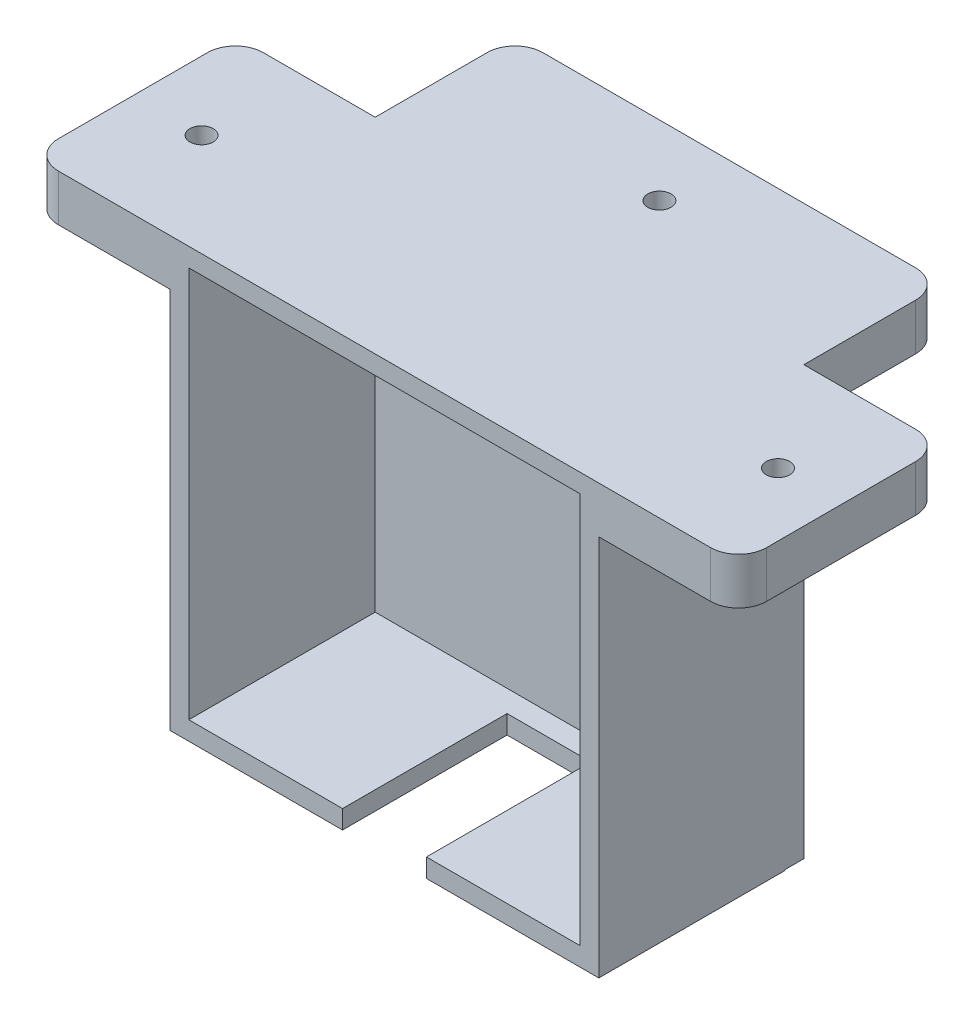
ISO-10303-21;
HEADER;
FILE_DESCRIPTION(('STEP AP214'),'2;1');
FILE_NAME('part.step','',(''),(''),'','','');
FILE_SCHEMA(('AUTOMOTIVE_DESIGN { 1 0 10303 214 1 1 1 1 }'));
ENDSEC;
DATA;
#1=APPLICATION_CONTEXT('core data for automotive mechanical design processes');
#2=APPLICATION_PROTOCOL_DEFINITION('international standard','automotive_design',2000,#1);
#3=PRODUCT_CONTEXT('',#1,'mechanical');
#4=PRODUCT('Part','Part','',(#3));
#5=PRODUCT_RELATED_PRODUCT_CATEGORY('part','',(#4));
#6=PRODUCT_DEFINITION_FORMATION('','',#4);
#7=PRODUCT_DEFINITION_CONTEXT('part definition',#1,'design');
#8=PRODUCT_DEFINITION('design','',#6,#7);
#9=PRODUCT_DEFINITION_SHAPE('','',#8);
#10=(LENGTH_UNIT() NAMED_UNIT(*) SI_UNIT(.MILLI.,.METRE.));
#11=(NAMED_UNIT(*) PLANE_ANGLE_UNIT() SI_UNIT($,.RADIAN.));
#12=(NAMED_UNIT(*) SI_UNIT($,.STERADIAN.) SOLID_ANGLE_UNIT());
#13=UNCERTAINTY_MEASURE_WITH_UNIT(LENGTH_MEASURE(1.E-05),#10,'distance_accuracy_value','');
#14=(GEOMETRIC_REPRESENTATION_CONTEXT(3) GLOBAL_UNCERTAINTY_ASSIGNED_CONTEXT((#13)) GLOBAL_UNIT_ASSIGNED_CONTEXT((#10,
#11,#12)) REPRESENTATION_CONTEXT('',''));
#15=CARTESIAN_POINT('',(0.,0.,0.));
#16=DIRECTION('',(0.,0.,1.));
#17=DIRECTION('',(1.,0.,0.));
#18=AXIS2_PLACEMENT_3D('',#15,#16,#17);
#19=CARTESIAN_POINT('',(-23.,23.,20.));
#20=DIRECTION('',(1.,0.,0.));
#21=DIRECTION('',(0.,0.,-1.));
#22=AXIS2_PLACEMENT_3D('',#19,#20,#21);
#23=PLANE('',#22);
#24=DIRECTION('',(0.,0.,1.));
#25=VECTOR('',#24,1.);
#26=CARTESIAN_POINT('',(-23.,18.,0.));
#27=LINE('',#26,#25);
#28=CARTESIAN_POINT('',(-23.,18.,-2.));
#29=VERTEX_POINT('',#28);
#30=CARTESIAN_POINT('',(-23.,18.,20.));
#31=VERTEX_POINT('',#30);
#32=EDGE_CURVE('E242',#29,#31,#27,.T.);
#33=ORIENTED_EDGE('',*,*,#32,.F.);
#34=DIRECTION('',(0.,1.,0.));
#35=VECTOR('',#34,1.);
#36=CARTESIAN_POINT('',(-23.,23.,-2.));
#37=LINE('',#36,#35);
#38=CARTESIAN_POINT('',(-23.,-22.9159249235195,-2.));
#39=VERTEX_POINT('',#38);
#40=EDGE_CURVE('E251',#39,#29,#37,.T.);
#41=ORIENTED_EDGE('',*,*,#40,.F.);
#42=DIRECTION('',(0.,0.,1.));
#43=VECTOR('',#42,1.);
#44=CARTESIAN_POINT('',(-23.,-22.9159249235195,-2.));
#45=LINE('',#44,#43);
#46=CARTESIAN_POINT('',(-23.,-22.9159249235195,0.));
#47=VERTEX_POINT('',#46);
#48=EDGE_CURVE('E273',#39,#47,#45,.T.);
#49=ORIENTED_EDGE('',*,*,#48,.T.);
#50=DIRECTION('',(0.,-1.,0.));
#51=VECTOR('',#50,1.);
#52=CARTESIAN_POINT('',(-23.,23.,0.));
#53=LINE('',#52,#51);
#54=CARTESIAN_POINT('',(-23.,-23.,0.));
#55=VERTEX_POINT('',#54);
#56=EDGE_CURVE('E321',#47,#55,#53,.T.);
#57=ORIENTED_EDGE('',*,*,#56,.T.);
#58=DIRECTION('',(0.,0.,-1.));
#59=VECTOR('',#58,1.);
#60=CARTESIAN_POINT('',(-23.,-23.,20.));
#61=LINE('',#60,#59);
#62=CARTESIAN_POINT('',(-23.,-23.,20.));
#63=VERTEX_POINT('',#62);
#64=EDGE_CURVE('E342',#63,#55,#61,.T.);
#65=ORIENTED_EDGE('',*,*,#64,.F.);
#66=DIRECTION('',(0.,-1.,0.));
#67=VECTOR('',#66,1.);
#68=CARTESIAN_POINT('',(-23.,23.,20.));
#69=LINE('',#68,#67);
#70=EDGE_CURVE('E253',#31,#63,#69,.T.);
#71=ORIENTED_EDGE('',*,*,#70,.F.);
#72=EDGE_LOOP('',(#33,#41,#49,#57,#65,#71));
#73=FACE_BOUND('',#72,.T.);
#74=ADVANCED_FACE('F35',(#73),#23,.F.);
#75=CARTESIAN_POINT('',(0.,0.,-2.));
#76=DIRECTION('',(0.,0.,-1.));
#77=DIRECTION('',(-1.,0.,0.));
#78=AXIS2_PLACEMENT_3D('',#75,#76,#77);
#79=PLANE('',#78);
#80=DIRECTION('',(1.,0.,0.));
#81=VECTOR('',#80,1.);
#82=CARTESIAN_POINT('',(23.,23.,-2.));
#83=LINE('',#82,#81);
#84=CARTESIAN_POINT('',(23.,23.,-2.));
#85=VERTEX_POINT('',#84);
#86=CARTESIAN_POINT('',(35.,23.,-2.));
#87=VERTEX_POINT('',#86);
#88=EDGE_CURVE('E270',#85,#87,#83,.T.);
#89=ORIENTED_EDGE('',*,*,#88,.T.);
#90=DIRECTION('',(0.,1.,0.));
#91=VECTOR('',#90,1.);
#92=CARTESIAN_POINT('',(35.,0.,-2.));
#93=LINE('',#92,#91);
#94=CARTESIAN_POINT('',(35.,18.,-2.));
#95=VERTEX_POINT('',#94);
#96=EDGE_CURVE('E384',#87,#95,#93,.F.);
#97=ORIENTED_EDGE('',*,*,#96,.T.);
#98=DIRECTION('',(-1.,0.,0.));
#99=VECTOR('',#98,1.);
#100=CARTESIAN_POINT('',(0.,18.,-2.));
#101=LINE('',#100,#99);
#102=CARTESIAN_POINT('',(23.,18.,-2.));
#103=VERTEX_POINT('',#102);
#104=EDGE_CURVE('E428',#95,#103,#101,.T.);
#105=ORIENTED_EDGE('',*,*,#104,.T.);
#106=DIRECTION('',(0.,1.,0.));
#107=VECTOR('',#106,1.);
#108=CARTESIAN_POINT('',(23.,18.,-2.));
#109=LINE('',#108,#107);
#110=EDGE_CURVE('E226',#103,#85,#109,.T.);
#111=ORIENTED_EDGE('',*,*,#110,.T.);
#112=EDGE_LOOP('',(#89,#97,#105,#111));
#113=FACE_BOUND('',#112,.T.);
#114=ADVANCED_FACE('F482',(#113),#79,.T.);
#115=CARTESIAN_POINT('',(23.,23.,20.));
#116=DIRECTION('',(-1.,0.,0.));
#117=DIRECTION('',(0.,-1.,0.));
#118=AXIS2_PLACEMENT_3D('',#115,#116,#117);
#119=PLANE('',#118);
#120=DIRECTION('',(0.,0.,-1.));
#121=VECTOR('',#120,1.);
#122=CARTESIAN_POINT('',(23.,18.,0.));
#123=LINE('',#122,#121);
#124=CARTESIAN_POINT('',(23.,18.,20.));
#125=VERTEX_POINT('',#124);
#126=EDGE_CURVE('E430',#125,#103,#123,.T.);
#127=ORIENTED_EDGE('',*,*,#126,.F.);
#128=DIRECTION('',(0.,1.,0.));
#129=VECTOR('',#128,1.);
#130=CARTESIAN_POINT('',(23.,23.,20.));
#131=LINE('',#130,#129);
#132=CARTESIAN_POINT('',(23.,-23.,20.));
#133=VERTEX_POINT('',#132);
#134=EDGE_CURVE('E331',#133,#125,#131,.T.);
#135=ORIENTED_EDGE('',*,*,#134,.F.);
#136=DIRECTION('',(0.,0.,-1.));
#137=VECTOR('',#136,1.);
#138=CARTESIAN_POINT('',(23.,-23.,20.));
#139=LINE('',#138,#137);
#140=CARTESIAN_POINT('',(23.,-23.,0.));
#141=VERTEX_POINT('',#140);
#142=EDGE_CURVE('E334',#133,#141,#139,.T.);
#143=ORIENTED_EDGE('',*,*,#142,.T.);
#144=DIRECTION('',(0.,1.,0.));
#145=VECTOR('',#144,1.);
#146=CARTESIAN_POINT('',(23.,23.,0.));
#147=LINE('',#146,#145);
#148=CARTESIAN_POINT('',(23.,-22.9159249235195,0.));
#149=VERTEX_POINT('',#148);
#150=EDGE_CURVE('E325',#141,#149,#147,.T.);
#151=ORIENTED_EDGE('',*,*,#150,.T.);
#152=DIRECTION('',(0.,0.,1.));
#153=VECTOR('',#152,1.);
#154=CARTESIAN_POINT('',(23.,-22.9159249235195,-2.));
#155=LINE('',#154,#153);
#156=CARTESIAN_POINT('',(23.,-22.9159249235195,-2.));
#157=VERTEX_POINT('',#156);
#158=EDGE_CURVE('E284',#157,#149,#155,.T.);
#159=ORIENTED_EDGE('',*,*,#158,.F.);
#160=DIRECTION('',(0.,-1.,0.));
#161=VECTOR('',#160,1.);
#162=CARTESIAN_POINT('',(23.,23.,-2.));
#163=LINE('',#162,#161);
#164=EDGE_CURVE('E275',#103,#157,#163,.T.);
#165=ORIENTED_EDGE('',*,*,#164,.F.);
#166=EDGE_LOOP('',(#127,#135,#143,#151,#159,#165));
#167=FACE_BOUND('',#166,.T.);
#168=ADVANCED_FACE('F458',(#167),#119,.F.);
#169=CARTESIAN_POINT('',(0.,0.,20.));
#170=DIRECTION('',(0.,0.,-1.));
#171=DIRECTION('',(-1.,0.,0.));
#172=AXIS2_PLACEMENT_3D('',#169,#170,#171);
#173=PLANE('',#172);
#174=DIRECTION('',(1.,0.,0.));
#175=VECTOR('',#174,1.);
#176=CARTESIAN_POINT('',(0.,18.,20.));
#177=LINE('',#176,#175);
#178=CARTESIAN_POINT('',(35.,18.,20.));
#179=VERTEX_POINT('',#178);
#180=EDGE_CURVE('E433',#125,#179,#177,.T.);
#181=ORIENTED_EDGE('',*,*,#180,.T.);
#182=DIRECTION('',(0.,1.,0.));
#183=VECTOR('',#182,1.);
#184=CARTESIAN_POINT('',(35.,23.,20.));
#185=LINE('',#184,#183);
#186=CARTESIAN_POINT('',(35.,23.,20.));
#187=VERTEX_POINT('',#186);
#188=EDGE_CURVE('E392',#179,#187,#185,.T.);
#189=ORIENTED_EDGE('',*,*,#188,.T.);
#190=DIRECTION('',(-1.,0.,0.));
#191=VECTOR('',#190,1.);
#192=CARTESIAN_POINT('',(-23.,23.,20.));
#193=LINE('',#192,#191);
#194=CARTESIAN_POINT('',(-35.,23.,20.));
#195=VERTEX_POINT('',#194);
#196=EDGE_CURVE('E322',#187,#195,#193,.T.);
#197=ORIENTED_EDGE('',*,*,#196,.T.);
#198=DIRECTION('',(0.,1.,0.));
#199=VECTOR('',#198,1.);
#200=CARTESIAN_POINT('',(-35.,18.,20.));
#201=LINE('',#200,#199);
#202=CARTESIAN_POINT('',(-35.,18.,20.));
#203=VERTEX_POINT('',#202);
#204=EDGE_CURVE('E390',#195,#203,#201,.F.);
#205=ORIENTED_EDGE('',*,*,#204,.T.);
#206=DIRECTION('',(1.,0.,0.));
#207=VECTOR('',#206,1.);
#208=CARTESIAN_POINT('',(0.,18.,20.));
#209=LINE('',#208,#207);
#210=EDGE_CURVE('E237',#203,#31,#209,.T.);
#211=ORIENTED_EDGE('',*,*,#210,.T.);
#212=ORIENTED_EDGE('',*,*,#70,.T.);
#213=DIRECTION('',(1.,0.,0.));
#214=VECTOR('',#213,1.);
#215=CARTESIAN_POINT('',(-23.,-23.,20.));
#216=LINE('',#215,#214);
#217=CARTESIAN_POINT('',(-4.5,-23.,20.));
#218=VERTEX_POINT('',#217);
#219=EDGE_CURVE('E328',#63,#218,#216,.T.);
#220=ORIENTED_EDGE('',*,*,#219,.T.);
#221=DIRECTION('',(0.,1.,0.));
#222=VECTOR('',#221,1.);
#223=CARTESIAN_POINT('',(-4.5,0.,20.));
#224=LINE('',#223,#222);
#225=CARTESIAN_POINT('',(-4.5,-21.,20.));
#226=VERTEX_POINT('',#225);
#227=EDGE_CURVE('E282',#218,#226,#224,.T.);
#228=ORIENTED_EDGE('',*,*,#227,.T.);
#229=DIRECTION('',(1.,0.,0.));
#230=VECTOR('',#229,1.);
#231=CARTESIAN_POINT('',(-21.,-21.,20.));
#232=LINE('',#231,#230);
#233=CARTESIAN_POINT('',(-21.,-21.,20.));
#234=VERTEX_POINT('',#233);
#235=EDGE_CURVE('E292',#234,#226,#232,.T.);
#236=ORIENTED_EDGE('',*,*,#235,.F.);
#237=DIRECTION('',(0.,-1.,0.));
#238=VECTOR('',#237,1.);
#239=CARTESIAN_POINT('',(-21.,21.,20.));
#240=LINE('',#239,#238);
#241=CARTESIAN_POINT('',(-21.,21.,20.));
#242=VERTEX_POINT('',#241);
#243=EDGE_CURVE('E288',#242,#234,#240,.T.);
#244=ORIENTED_EDGE('',*,*,#243,.F.);
#245=DIRECTION('',(-1.,0.,0.));
#246=VECTOR('',#245,1.);
#247=CARTESIAN_POINT('',(-21.,21.,20.));
#248=LINE('',#247,#246);
#249=CARTESIAN_POINT('',(21.,21.,20.));
#250=VERTEX_POINT('',#249);
#251=EDGE_CURVE('E298',#250,#242,#248,.T.);
#252=ORIENTED_EDGE('',*,*,#251,.F.);
#253=DIRECTION('',(0.,1.,0.));
#254=VECTOR('',#253,1.);
#255=CARTESIAN_POINT('',(21.,21.,20.));
#256=LINE('',#255,#254);
#257=CARTESIAN_POINT('',(21.,-21.,20.));
#258=VERTEX_POINT('',#257);
#259=EDGE_CURVE('E295',#258,#250,#256,.T.);
#260=ORIENTED_EDGE('',*,*,#259,.F.);
#261=CARTESIAN_POINT('',(4.5,-21.,20.));
#262=VERTEX_POINT('',#261);
#263=EDGE_CURVE('E290',#262,#258,#232,.T.);
#264=ORIENTED_EDGE('',*,*,#263,.F.);
#265=DIRECTION('',(0.,-1.,0.));
#266=VECTOR('',#265,1.);
#267=CARTESIAN_POINT('',(4.5,0.,20.));
#268=LINE('',#267,#266);
#269=CARTESIAN_POINT('',(4.5,-23.,20.));
#270=VERTEX_POINT('',#269);
#271=EDGE_CURVE('E448',#262,#270,#268,.T.);
#272=ORIENTED_EDGE('',*,*,#271,.T.);
#273=EDGE_CURVE('E327',#270,#133,#216,.T.);
#274=ORIENTED_EDGE('',*,*,#273,.T.);
#275=ORIENTED_EDGE('',*,*,#134,.T.);
#276=EDGE_LOOP('',(#181,#189,#197,#205,#211,#212,#220,#228,#236,#244,#252,#260,#264,#272,#274,#275));
#277=FACE_BOUND('',#276,.T.);
#278=ADVANCED_FACE('F471',(#277),#173,.F.);
#279=CARTESIAN_POINT('',(0.,0.,0.));
#280=DIRECTION('',(0.,0.,-1.));
#281=DIRECTION('',(-1.,0.,0.));
#282=AXIS2_PLACEMENT_3D('',#279,#280,#281);
#283=PLANE('',#282);
#284=DIRECTION('',(-1.,0.,0.));
#285=VECTOR('',#284,1.);
#286=CARTESIAN_POINT('',(23.,-22.9159249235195,0.));
#287=LINE('',#286,#285);
#288=EDGE_CURVE('E279',#149,#47,#287,.T.);
#289=ORIENTED_EDGE('',*,*,#288,.F.);
#290=ORIENTED_EDGE('',*,*,#150,.F.);
#291=DIRECTION('',(1.,0.,0.));
#292=VECTOR('',#291,1.);
#293=CARTESIAN_POINT('',(-23.,-23.,0.));
#294=LINE('',#293,#292);
#295=EDGE_CURVE('E336',#55,#141,#294,.T.);
#296=ORIENTED_EDGE('',*,*,#295,.F.);
#297=ORIENTED_EDGE('',*,*,#56,.F.);
#298=EDGE_LOOP('',(#289,#290,#296,#297));
#299=FACE_BOUND('',#298,.T.);
#300=ADVANCED_FACE('F464',(#299),#283,.T.);
#301=CARTESIAN_POINT('',(-23.,23.,20.));
#302=DIRECTION('',(0.,-1.,0.));
#303=DIRECTION('',(0.,0.,-1.));
#304=AXIS2_PLACEMENT_3D('',#301,#302,#303);
#305=PLANE('',#304);
#306=CARTESIAN_POINT('',(-30.6312111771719,23.,9.));
#307=DIRECTION('',(0.,-1.,0.));
#308=DIRECTION('',(0.,0.,-1.));
#309=AXIS2_PLACEMENT_3D('',#306,#307,#308);
#310=CIRCLE('',#309,1.25);
#311=CARTESIAN_POINT('',(-30.6312111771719,23.,7.75));
#312=VERTEX_POINT('',#311);
#313=EDGE_CURVE('E798',#312,#312,#310,.T.);
#314=ORIENTED_EDGE('',*,*,#313,.T.);
#315=EDGE_LOOP('',(#314));
#316=FACE_BOUND('',#315,.T.);
#317=CARTESIAN_POINT('',(0.,23.,-9.49999999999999));
#318=DIRECTION('',(0.,-1.,0.));
#319=DIRECTION('',(0.,0.,-1.));
#320=AXIS2_PLACEMENT_3D('',#317,#318,#319);
#321=CIRCLE('',#320,1.25);
#322=CARTESIAN_POINT('',(0.,23.,-10.75));
#323=VERTEX_POINT('',#322);
#324=EDGE_CURVE('E795',#323,#323,#321,.T.);
#325=ORIENTED_EDGE('',*,*,#324,.T.);
#326=EDGE_LOOP('',(#325));
#327=FACE_BOUND('',#326,.T.);
#328=CARTESIAN_POINT('',(31.2306477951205,23.,9.));
#329=DIRECTION('',(0.,-1.,0.));
#330=DIRECTION('',(0.,0.,-1.));
#331=AXIS2_PLACEMENT_3D('',#328,#329,#330);
#332=CIRCLE('',#331,1.25);
#333=CARTESIAN_POINT('',(31.2306477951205,23.,7.75));
#334=VERTEX_POINT('',#333);
#335=EDGE_CURVE('E414',#334,#334,#332,.T.);
#336=ORIENTED_EDGE('',*,*,#335,.T.);
#337=EDGE_LOOP('',(#336));
#338=FACE_BOUND('',#337,.T.);
#339=DIRECTION('',(0.,0.,-1.));
#340=VECTOR('',#339,1.);
#341=CARTESIAN_POINT('',(23.,23.,0.));
#342=LINE('',#341,#340);
#343=CARTESIAN_POINT('',(23.,23.,-14.));
#344=VERTEX_POINT('',#343);
#345=EDGE_CURVE('E417',#85,#344,#342,.T.);
#346=ORIENTED_EDGE('',*,*,#345,.T.);
#347=CARTESIAN_POINT('',(20.,23.,-14.));
#348=DIRECTION('',(0.,-1.,0.));
#349=DIRECTION('',(0.,0.,-1.));
#350=AXIS2_PLACEMENT_3D('',#347,#348,#349);
#351=CIRCLE('',#350,3.);
#352=CARTESIAN_POINT('',(20.,23.,-17.));
#353=VERTEX_POINT('',#352);
#354=EDGE_CURVE('E367',#344,#353,#351,.F.);
#355=ORIENTED_EDGE('',*,*,#354,.T.);
#356=DIRECTION('',(-1.,0.,0.));
#357=VECTOR('',#356,1.);
#358=CARTESIAN_POINT('',(0.,23.,-17.));
#359=LINE('',#358,#357);
#360=CARTESIAN_POINT('',(-20.,23.,-17.));
#361=VERTEX_POINT('',#360);
#362=EDGE_CURVE('E264',#353,#361,#359,.T.);
#363=ORIENTED_EDGE('',*,*,#362,.T.);
#364=CARTESIAN_POINT('',(-20.,23.,-14.));
#365=DIRECTION('',(0.,-1.,0.));
#366=DIRECTION('',(0.,0.,-1.));
#367=AXIS2_PLACEMENT_3D('',#364,#365,#366);
#368=CIRCLE('',#367,3.);
#369=CARTESIAN_POINT('',(-23.,23.,-14.));
#370=VERTEX_POINT('',#369);
#371=EDGE_CURVE('E365',#361,#370,#368,.F.);
#372=ORIENTED_EDGE('',*,*,#371,.T.);
#373=DIRECTION('',(0.,0.,-1.));
#374=VECTOR('',#373,1.);
#375=CARTESIAN_POINT('',(-23.,23.,20.));
#376=LINE('',#375,#374);
#377=CARTESIAN_POINT('',(-23.,23.,-2.));
#378=VERTEX_POINT('',#377);
#379=EDGE_CURVE('E345',#378,#370,#376,.T.);
#380=ORIENTED_EDGE('',*,*,#379,.F.);
#381=DIRECTION('',(-1.,0.,0.));
#382=VECTOR('',#381,1.);
#383=CARTESIAN_POINT('',(0.,23.,-2.));
#384=LINE('',#383,#382);
#385=CARTESIAN_POINT('',(-35.,23.,-2.));
#386=VERTEX_POINT('',#385);
#387=EDGE_CURVE('E236',#378,#386,#384,.T.);
#388=ORIENTED_EDGE('',*,*,#387,.T.);
#389=CARTESIAN_POINT('',(-35.,23.,1.));
#390=DIRECTION('',(0.,-1.,0.));
#391=DIRECTION('',(0.,0.,-1.));
#392=AXIS2_PLACEMENT_3D('',#389,#390,#391);
#393=CIRCLE('',#392,3.);
#394=CARTESIAN_POINT('',(-38.,23.,1.));
#395=VERTEX_POINT('',#394);
#396=EDGE_CURVE('E359',#386,#395,#393,.F.);
#397=ORIENTED_EDGE('',*,*,#396,.T.);
#398=DIRECTION('',(0.,0.,1.));
#399=VECTOR('',#398,1.);
#400=CARTESIAN_POINT('',(-38.,23.,0.));
#401=LINE('',#400,#399);
#402=CARTESIAN_POINT('',(-38.,23.,17.));
#403=VERTEX_POINT('',#402);
#404=EDGE_CURVE('E254',#395,#403,#401,.T.);
#405=ORIENTED_EDGE('',*,*,#404,.T.);
#406=CARTESIAN_POINT('',(-35.,23.,17.));
#407=DIRECTION('',(0.,-1.,0.));
#408=DIRECTION('',(0.,0.,-1.));
#409=AXIS2_PLACEMENT_3D('',#406,#407,#408);
#410=CIRCLE('',#409,3.);
#411=EDGE_CURVE('E357',#403,#195,#410,.F.);
#412=ORIENTED_EDGE('',*,*,#411,.T.);
#413=ORIENTED_EDGE('',*,*,#196,.F.);
#414=CARTESIAN_POINT('',(35.,23.,17.));
#415=DIRECTION('',(0.,-1.,0.));
#416=DIRECTION('',(0.,0.,-1.));
#417=AXIS2_PLACEMENT_3D('',#414,#415,#416);
#418=CIRCLE('',#417,3.);
#419=CARTESIAN_POINT('',(38.,23.,17.));
#420=VERTEX_POINT('',#419);
#421=EDGE_CURVE('E361',#187,#420,#418,.F.);
#422=ORIENTED_EDGE('',*,*,#421,.T.);
#423=DIRECTION('',(0.,0.,-1.));
#424=VECTOR('',#423,1.);
#425=CARTESIAN_POINT('',(38.,23.,0.));
#426=LINE('',#425,#424);
#427=CARTESIAN_POINT('',(38.,23.,1.));
#428=VERTEX_POINT('',#427);
#429=EDGE_CURVE('E419',#420,#428,#426,.T.);
#430=ORIENTED_EDGE('',*,*,#429,.T.);
#431=CARTESIAN_POINT('',(35.,23.,1.));
#432=DIRECTION('',(0.,-1.,0.));
#433=DIRECTION('',(0.,0.,-1.));
#434=AXIS2_PLACEMENT_3D('',#431,#432,#433);
#435=CIRCLE('',#434,3.);
#436=EDGE_CURVE('E363',#428,#87,#435,.F.);
#437=ORIENTED_EDGE('',*,*,#436,.T.);
#438=ORIENTED_EDGE('',*,*,#88,.F.);
#439=EDGE_LOOP('',(#346,#355,#363,#372,#380,#388,#397,#405,#412,#413,#422,#430,#437,#438));
#440=FACE_BOUND('',#439,.T.);
#441=ADVANCED_FACE('F406',(#316,#327,#338,#440),#305,.F.);
#442=ORIENTED_EDGE('',*,*,#379,.T.);
#443=DIRECTION('',(0.,1.,0.));
#444=VECTOR('',#443,1.);
#445=CARTESIAN_POINT('',(-23.,18.,-14.));
#446=LINE('',#445,#444);
#447=CARTESIAN_POINT('',(-23.,18.,-14.));
#448=VERTEX_POINT('',#447);
#449=EDGE_CURVE('E221',#370,#448,#446,.F.);
#450=ORIENTED_EDGE('',*,*,#449,.T.);
#451=DIRECTION('',(0.,0.,1.));
#452=VECTOR('',#451,1.);
#453=CARTESIAN_POINT('',(-23.,18.,0.));
#454=LINE('',#453,#452);
#455=EDGE_CURVE('E214',#448,#29,#454,.T.);
#456=ORIENTED_EDGE('',*,*,#455,.T.);
#457=DIRECTION('',(0.,1.,0.));
#458=VECTOR('',#457,1.);
#459=CARTESIAN_POINT('',(-23.,18.,-2.));
#460=LINE('',#459,#458);
#461=EDGE_CURVE('E218',#29,#378,#460,.T.);
#462=ORIENTED_EDGE('',*,*,#461,.T.);
#463=EDGE_LOOP('',(#442,#450,#456,#462));
#464=FACE_BOUND('',#463,.T.);
#465=ADVANCED_FACE('F217',(#464),#23,.F.);
#466=CARTESIAN_POINT('',(-23.,-23.,20.));
#467=DIRECTION('',(0.,1.,0.));
#468=DIRECTION('',(-1.,0.,0.));
#469=AXIS2_PLACEMENT_3D('',#466,#467,#468);
#470=PLANE('',#469);
#471=DIRECTION('',(1.,0.,0.));
#472=VECTOR('',#471,1.);
#473=CARTESIAN_POINT('',(-4.5,-23.,2.34644712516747));
#474=LINE('',#473,#472);
#475=CARTESIAN_POINT('',(-4.5,-23.,2.34644712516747));
#476=VERTEX_POINT('',#475);
#477=CARTESIAN_POINT('',(4.5,-23.,2.34644712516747));
#478=VERTEX_POINT('',#477);
#479=EDGE_CURVE('E440',#476,#478,#474,.T.);
#480=ORIENTED_EDGE('',*,*,#479,.F.);
#481=DIRECTION('',(0.,0.,-1.));
#482=VECTOR('',#481,1.);
#483=CARTESIAN_POINT('',(-4.5,-23.,39.1871089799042));
#484=LINE('',#483,#482);
#485=EDGE_CURVE('E436',#218,#476,#484,.T.);
#486=ORIENTED_EDGE('',*,*,#485,.F.);
#487=ORIENTED_EDGE('',*,*,#219,.F.);
#488=ORIENTED_EDGE('',*,*,#64,.T.);
#489=ORIENTED_EDGE('',*,*,#295,.T.);
#490=ORIENTED_EDGE('',*,*,#142,.F.);
#491=ORIENTED_EDGE('',*,*,#273,.F.);
#492=DIRECTION('',(0.,0.,1.));
#493=VECTOR('',#492,1.);
#494=CARTESIAN_POINT('',(4.5,-23.,39.1871089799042));
#495=LINE('',#494,#493);
#496=EDGE_CURVE('E443',#478,#270,#495,.T.);
#497=ORIENTED_EDGE('',*,*,#496,.F.);
#498=EDGE_LOOP('',(#480,#486,#487,#488,#489,#490,#491,#497));
#499=FACE_BOUND('',#498,.T.);
#500=ADVANCED_FACE('F468',(#499),#470,.F.);
#501=CARTESIAN_POINT('',(-21.,21.,20.));
#502=DIRECTION('',(1.,0.,0.));
#503=DIRECTION('',(0.,1.,0.));
#504=AXIS2_PLACEMENT_3D('',#501,#502,#503);
#505=PLANE('',#504);
#506=DIRECTION('',(0.,-1.,0.));
#507=VECTOR('',#506,1.);
#508=CARTESIAN_POINT('',(-21.,21.,0.));
#509=LINE('',#508,#507);
#510=CARTESIAN_POINT('',(-21.,21.,0.));
#511=VERTEX_POINT('',#510);
#512=CARTESIAN_POINT('',(-21.,-21.,0.));
#513=VERTEX_POINT('',#512);
#514=EDGE_CURVE('E287',#511,#513,#509,.T.);
#515=ORIENTED_EDGE('',*,*,#514,.F.);
#516=DIRECTION('',(0.,0.,-1.));
#517=VECTOR('',#516,1.);
#518=CARTESIAN_POINT('',(-21.,21.,20.));
#519=LINE('',#518,#517);
#520=EDGE_CURVE('E300',#242,#511,#519,.T.);
#521=ORIENTED_EDGE('',*,*,#520,.F.);
#522=ORIENTED_EDGE('',*,*,#243,.T.);
#523=DIRECTION('',(0.,0.,-1.));
#524=VECTOR('',#523,1.);
#525=CARTESIAN_POINT('',(-21.,-21.,20.));
#526=LINE('',#525,#524);
#527=EDGE_CURVE('E318',#234,#513,#526,.T.);
#528=ORIENTED_EDGE('',*,*,#527,.T.);
#529=EDGE_LOOP('',(#515,#521,#522,#528));
#530=FACE_BOUND('',#529,.T.);
#531=ADVANCED_FACE('F498',(#530),#505,.T.);
#532=CARTESIAN_POINT('',(-21.,-21.,20.));
#533=DIRECTION('',(0.,1.,0.));
#534=DIRECTION('',(0.,0.,1.));
#535=AXIS2_PLACEMENT_3D('',#532,#533,#534);
#536=PLANE('',#535);
#537=DIRECTION('',(0.,0.,1.));
#538=VECTOR('',#537,1.);
#539=CARTESIAN_POINT('',(-4.5,-21.,20.));
#540=LINE('',#539,#538);
#541=CARTESIAN_POINT('',(-4.5,-21.,2.34644712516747));
#542=VERTEX_POINT('',#541);
#543=EDGE_CURVE('E352',#542,#226,#540,.T.);
#544=ORIENTED_EDGE('',*,*,#543,.F.);
#545=DIRECTION('',(-1.,0.,0.));
#546=VECTOR('',#545,1.);
#547=CARTESIAN_POINT('',(-21.,-21.,2.34644712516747));
#548=LINE('',#547,#546);
#549=CARTESIAN_POINT('',(4.5,-21.,2.34644712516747));
#550=VERTEX_POINT('',#549);
#551=EDGE_CURVE('E347',#550,#542,#548,.T.);
#552=ORIENTED_EDGE('',*,*,#551,.F.);
#553=DIRECTION('',(0.,0.,-1.));
#554=VECTOR('',#553,1.);
#555=CARTESIAN_POINT('',(4.5,-21.,20.));
#556=LINE('',#555,#554);
#557=EDGE_CURVE('E349',#262,#550,#556,.T.);
#558=ORIENTED_EDGE('',*,*,#557,.F.);
#559=ORIENTED_EDGE('',*,*,#263,.T.);
#560=DIRECTION('',(0.,0.,-1.));
#561=VECTOR('',#560,1.);
#562=CARTESIAN_POINT('',(21.,-21.,20.));
#563=LINE('',#562,#561);
#564=CARTESIAN_POINT('',(21.,-21.,0.));
#565=VERTEX_POINT('',#564);
#566=EDGE_CURVE('E316',#258,#565,#563,.T.);
#567=ORIENTED_EDGE('',*,*,#566,.T.);
#568=DIRECTION('',(1.,0.,0.));
#569=VECTOR('',#568,1.);
#570=CARTESIAN_POINT('',(-21.,-21.,0.));
#571=LINE('',#570,#569);
#572=EDGE_CURVE('E303',#513,#565,#571,.T.);
#573=ORIENTED_EDGE('',*,*,#572,.F.);
#574=ORIENTED_EDGE('',*,*,#527,.F.);
#575=ORIENTED_EDGE('',*,*,#235,.T.);
#576=EDGE_LOOP('',(#544,#552,#558,#559,#567,#573,#574,#575));
#577=FACE_BOUND('',#576,.T.);
#578=ADVANCED_FACE('F593',(#577),#536,.T.);
#579=CARTESIAN_POINT('',(21.,21.,20.));
#580=DIRECTION('',(-1.,0.,0.));
#581=DIRECTION('',(0.,0.,1.));
#582=AXIS2_PLACEMENT_3D('',#579,#580,#581);
#583=PLANE('',#582);
#584=DIRECTION('',(0.,1.,0.));
#585=VECTOR('',#584,1.);
#586=CARTESIAN_POINT('',(21.,21.,0.));
#587=LINE('',#586,#585);
#588=CARTESIAN_POINT('',(21.,21.,0.));
#589=VERTEX_POINT('',#588);
#590=EDGE_CURVE('E306',#565,#589,#587,.T.);
#591=ORIENTED_EDGE('',*,*,#590,.F.);
#592=ORIENTED_EDGE('',*,*,#566,.F.);
#593=ORIENTED_EDGE('',*,*,#259,.T.);
#594=DIRECTION('',(0.,0.,-1.));
#595=VECTOR('',#594,1.);
#596=CARTESIAN_POINT('',(21.,21.,20.));
#597=LINE('',#596,#595);
#598=EDGE_CURVE('E313',#250,#589,#597,.T.);
#599=ORIENTED_EDGE('',*,*,#598,.T.);
#600=EDGE_LOOP('',(#591,#592,#593,#599));
#601=FACE_BOUND('',#600,.T.);
#602=ADVANCED_FACE('F589',(#601),#583,.T.);
#603=CARTESIAN_POINT('',(-21.,21.,20.));
#604=DIRECTION('',(0.,-1.,0.));
#605=DIRECTION('',(0.,0.,-1.));
#606=AXIS2_PLACEMENT_3D('',#603,#604,#605);
#607=PLANE('',#606);
#608=DIRECTION('',(-1.,0.,0.));
#609=VECTOR('',#608,1.);
#610=CARTESIAN_POINT('',(-21.,21.,0.));
#611=LINE('',#610,#609);
#612=EDGE_CURVE('E291',#589,#511,#611,.T.);
#613=ORIENTED_EDGE('',*,*,#612,.F.);
#614=ORIENTED_EDGE('',*,*,#598,.F.);
#615=ORIENTED_EDGE('',*,*,#251,.T.);
#616=ORIENTED_EDGE('',*,*,#520,.T.);
#617=EDGE_LOOP('',(#613,#614,#615,#616));
#618=FACE_BOUND('',#617,.T.);
#619=ADVANCED_FACE('F581',(#618),#607,.T.);
#620=DIRECTION('',(-1.,0.,0.));
#621=VECTOR('',#620,1.);
#622=CARTESIAN_POINT('',(0.,18.,-2.));
#623=LINE('',#622,#621);
#624=EDGE_CURVE('E225',#103,#29,#623,.T.);
#625=ORIENTED_EDGE('',*,*,#624,.F.);
#626=ORIENTED_EDGE('',*,*,#164,.T.);
#627=DIRECTION('',(-1.,0.,0.));
#628=VECTOR('',#627,1.);
#629=CARTESIAN_POINT('',(23.,-22.9159249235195,-2.));
#630=LINE('',#629,#628);
#631=EDGE_CURVE('E268',#157,#39,#630,.T.);
#632=ORIENTED_EDGE('',*,*,#631,.T.);
#633=ORIENTED_EDGE('',*,*,#40,.T.);
#634=EDGE_LOOP('',(#625,#626,#632,#633));
#635=FACE_BOUND('',#634,.T.);
#636=ADVANCED_FACE('F266',(#635),#79,.T.);
#637=CARTESIAN_POINT('',(23.,-22.9159249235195,-2.));
#638=DIRECTION('',(0.,1.,0.));
#639=DIRECTION('',(0.,0.,1.));
#640=AXIS2_PLACEMENT_3D('',#637,#638,#639);
#641=PLANE('',#640);
#642=ORIENTED_EDGE('',*,*,#288,.T.);
#643=ORIENTED_EDGE('',*,*,#48,.F.);
#644=ORIENTED_EDGE('',*,*,#631,.F.);
#645=ORIENTED_EDGE('',*,*,#158,.T.);
#646=EDGE_LOOP('',(#642,#643,#644,#645));
#647=FACE_BOUND('',#646,.T.);
#648=ADVANCED_FACE('F457',(#647),#641,.F.);
#649=CARTESIAN_POINT('',(0.,0.,0.));
#650=DIRECTION('',(0.,0.,-1.));
#651=DIRECTION('',(-1.,0.,0.));
#652=AXIS2_PLACEMENT_3D('',#649,#650,#651);
#653=PLANE('',#652);
#654=ORIENTED_EDGE('',*,*,#590,.T.);
#655=ORIENTED_EDGE('',*,*,#612,.T.);
#656=ORIENTED_EDGE('',*,*,#514,.T.);
#657=ORIENTED_EDGE('',*,*,#572,.T.);
#658=EDGE_LOOP('',(#654,#655,#656,#657));
#659=FACE_BOUND('',#658,.T.);
#660=ADVANCED_FACE('F577',(#659),#653,.F.);
#661=CARTESIAN_POINT('',(-4.5,-3.,39.1871089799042));
#662=DIRECTION('',(-1.,0.,0.));
#663=DIRECTION('',(0.,-1.,0.));
#664=AXIS2_PLACEMENT_3D('',#661,#662,#663);
#665=PLANE('',#664);
#666=ORIENTED_EDGE('',*,*,#485,.T.);
#667=DIRECTION('',(0.,-1.,0.));
#668=VECTOR('',#667,1.);
#669=CARTESIAN_POINT('',(-4.5,-3.,2.34644712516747));
#670=LINE('',#669,#668);
#671=EDGE_CURVE('E445',#542,#476,#670,.T.);
#672=ORIENTED_EDGE('',*,*,#671,.F.);
#673=ORIENTED_EDGE('',*,*,#543,.T.);
#674=ORIENTED_EDGE('',*,*,#227,.F.);
#675=EDGE_LOOP('',(#666,#672,#673,#674));
#676=FACE_BOUND('',#675,.T.);
#677=ADVANCED_FACE('F571',(#676),#665,.F.);
#678=CARTESIAN_POINT('',(4.5,-3.,39.1871089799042));
#679=DIRECTION('',(1.,0.,0.));
#680=DIRECTION('',(0.,1.,0.));
#681=AXIS2_PLACEMENT_3D('',#678,#679,#680);
#682=PLANE('',#681);
#683=ORIENTED_EDGE('',*,*,#557,.T.);
#684=DIRECTION('',(0.,-1.,0.));
#685=VECTOR('',#684,1.);
#686=CARTESIAN_POINT('',(4.5,-3.,2.34644712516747));
#687=LINE('',#686,#685);
#688=EDGE_CURVE('E446',#550,#478,#687,.T.);
#689=ORIENTED_EDGE('',*,*,#688,.T.);
#690=ORIENTED_EDGE('',*,*,#496,.T.);
#691=ORIENTED_EDGE('',*,*,#271,.F.);
#692=EDGE_LOOP('',(#683,#689,#690,#691));
#693=FACE_BOUND('',#692,.T.);
#694=ADVANCED_FACE('F568',(#693),#682,.F.);
#695=CARTESIAN_POINT('',(-4.5,-3.,2.34644712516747));
#696=DIRECTION('',(0.,0.,-1.));
#697=DIRECTION('',(-1.,0.,0.));
#698=AXIS2_PLACEMENT_3D('',#695,#696,#697);
#699=PLANE('',#698);
#700=ORIENTED_EDGE('',*,*,#551,.T.);
#701=ORIENTED_EDGE('',*,*,#671,.T.);
#702=ORIENTED_EDGE('',*,*,#479,.T.);
#703=ORIENTED_EDGE('',*,*,#688,.F.);
#704=EDGE_LOOP('',(#700,#701,#702,#703));
#705=FACE_BOUND('',#704,.T.);
#706=ADVANCED_FACE('F567',(#705),#699,.F.);
#707=CARTESIAN_POINT('',(38.,18.,0.));
#708=DIRECTION('',(1.,0.,0.));
#709=DIRECTION('',(0.,0.,-1.));
#710=AXIS2_PLACEMENT_3D('',#707,#708,#709);
#711=PLANE('',#710);
#712=DIRECTION('',(0.,0.,-1.));
#713=VECTOR('',#712,1.);
#714=CARTESIAN_POINT('',(38.,18.,0.));
#715=LINE('',#714,#713);
#716=CARTESIAN_POINT('',(38.,18.,17.));
#717=VERTEX_POINT('',#716);
#718=CARTESIAN_POINT('',(38.,18.,1.));
#719=VERTEX_POINT('',#718);
#720=EDGE_CURVE('E425',#717,#719,#715,.T.);
#721=ORIENTED_EDGE('',*,*,#720,.T.);
#722=DIRECTION('',(0.,1.,0.));
#723=VECTOR('',#722,1.);
#724=CARTESIAN_POINT('',(38.,18.,1.));
#725=LINE('',#724,#723);
#726=EDGE_CURVE('E381',#719,#428,#725,.T.);
#727=ORIENTED_EDGE('',*,*,#726,.T.);
#728=ORIENTED_EDGE('',*,*,#429,.F.);
#729=DIRECTION('',(0.,1.,0.));
#730=VECTOR('',#729,1.);
#731=CARTESIAN_POINT('',(38.,18.,17.));
#732=LINE('',#731,#730);
#733=EDGE_CURVE('E379',#420,#717,#732,.F.);
#734=ORIENTED_EDGE('',*,*,#733,.T.);
#735=EDGE_LOOP('',(#721,#727,#728,#734));
#736=FACE_BOUND('',#735,.T.);
#737=ADVANCED_FACE('F540',(#736),#711,.T.);
#738=CARTESIAN_POINT('',(0.,18.,0.));
#739=DIRECTION('',(0.,1.,0.));
#740=DIRECTION('',(0.,0.,1.));
#741=AXIS2_PLACEMENT_3D('',#738,#739,#740);
#742=PLANE('',#741);
#743=CARTESIAN_POINT('',(31.2306477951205,18.,9.));
#744=DIRECTION('',(0.,-1.,0.));
#745=DIRECTION('',(0.,0.,-1.));
#746=AXIS2_PLACEMENT_3D('',#743,#744,#745);
#747=CIRCLE('',#746,1.25);
#748=CARTESIAN_POINT('',(31.2306477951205,18.,7.75));
#749=VERTEX_POINT('',#748);
#750=EDGE_CURVE('E791',#749,#749,#747,.T.);
#751=ORIENTED_EDGE('',*,*,#750,.F.);
#752=EDGE_LOOP('',(#751));
#753=FACE_BOUND('',#752,.T.);
#754=ORIENTED_EDGE('',*,*,#104,.F.);
#755=CARTESIAN_POINT('',(35.,18.,1.));
#756=DIRECTION('',(0.,1.,0.));
#757=DIRECTION('',(0.,0.,1.));
#758=AXIS2_PLACEMENT_3D('',#755,#756,#757);
#759=CIRCLE('',#758,3.);
#760=EDGE_CURVE('E388',#95,#719,#759,.F.);
#761=ORIENTED_EDGE('',*,*,#760,.T.);
#762=ORIENTED_EDGE('',*,*,#720,.F.);
#763=CARTESIAN_POINT('',(35.,18.,17.));
#764=DIRECTION('',(0.,1.,0.));
#765=DIRECTION('',(0.,0.,1.));
#766=AXIS2_PLACEMENT_3D('',#763,#764,#765);
#767=CIRCLE('',#766,3.);
#768=EDGE_CURVE('E386',#717,#179,#767,.F.);
#769=ORIENTED_EDGE('',*,*,#768,.T.);
#770=ORIENTED_EDGE('',*,*,#180,.F.);
#771=ORIENTED_EDGE('',*,*,#126,.T.);
#772=EDGE_LOOP('',(#754,#761,#762,#769,#770,#771));
#773=FACE_BOUND('',#772,.T.);
#774=ADVANCED_FACE('F532',(#753,#773),#742,.F.);
#775=CARTESIAN_POINT('',(0.,18.,-17.));
#776=DIRECTION('',(0.,0.,-1.));
#777=DIRECTION('',(-1.,0.,0.));
#778=AXIS2_PLACEMENT_3D('',#775,#776,#777);
#779=PLANE('',#778);
#780=ORIENTED_EDGE('',*,*,#362,.F.);
#781=DIRECTION('',(0.,1.,0.));
#782=VECTOR('',#781,1.);
#783=CARTESIAN_POINT('',(20.,18.,-17.));
#784=LINE('',#783,#782);
#785=CARTESIAN_POINT('',(20.,18.,-17.));
#786=VERTEX_POINT('',#785);
#787=EDGE_CURVE('E372',#353,#786,#784,.F.);
#788=ORIENTED_EDGE('',*,*,#787,.T.);
#789=DIRECTION('',(-1.,0.,0.));
#790=VECTOR('',#789,1.);
#791=CARTESIAN_POINT('',(0.,18.,-17.));
#792=LINE('',#791,#790);
#793=CARTESIAN_POINT('',(-20.,18.,-17.));
#794=VERTEX_POINT('',#793);
#795=EDGE_CURVE('E409',#786,#794,#792,.T.);
#796=ORIENTED_EDGE('',*,*,#795,.T.);
#797=DIRECTION('',(0.,1.,0.));
#798=VECTOR('',#797,1.);
#799=CARTESIAN_POINT('',(-20.,23.,-17.));
#800=LINE('',#799,#798);
#801=EDGE_CURVE('E369',#794,#361,#800,.T.);
#802=ORIENTED_EDGE('',*,*,#801,.T.);
#803=EDGE_LOOP('',(#780,#788,#796,#802));
#804=FACE_BOUND('',#803,.T.);
#805=ADVANCED_FACE('F548',(#804),#779,.T.);
#806=CARTESIAN_POINT('',(23.,18.,0.));
#807=DIRECTION('',(1.,0.,0.));
#808=DIRECTION('',(0.,0.,-1.));
#809=AXIS2_PLACEMENT_3D('',#806,#807,#808);
#810=PLANE('',#809);
#811=DIRECTION('',(0.,0.,-1.));
#812=VECTOR('',#811,1.);
#813=CARTESIAN_POINT('',(23.,18.,0.));
#814=LINE('',#813,#812);
#815=CARTESIAN_POINT('',(23.,18.,-14.));
#816=VERTEX_POINT('',#815);
#817=EDGE_CURVE('E261',#103,#816,#814,.T.);
#818=ORIENTED_EDGE('',*,*,#817,.T.);
#819=DIRECTION('',(0.,1.,0.));
#820=VECTOR('',#819,1.);
#821=CARTESIAN_POINT('',(23.,18.,-14.));
#822=LINE('',#821,#820);
#823=EDGE_CURVE('E354',#816,#344,#822,.T.);
#824=ORIENTED_EDGE('',*,*,#823,.T.);
#825=ORIENTED_EDGE('',*,*,#345,.F.);
#826=ORIENTED_EDGE('',*,*,#110,.F.);
#827=EDGE_LOOP('',(#818,#824,#825,#826));
#828=FACE_BOUND('',#827,.T.);
#829=ADVANCED_FACE('F543',(#828),#810,.T.);
#830=CARTESIAN_POINT('',(0.,18.,0.));
#831=DIRECTION('',(0.,1.,0.));
#832=DIRECTION('',(0.,0.,1.));
#833=AXIS2_PLACEMENT_3D('',#830,#831,#832);
#834=PLANE('',#833);
#835=CARTESIAN_POINT('',(0.,18.,-9.49999999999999));
#836=DIRECTION('',(0.,-1.,0.));
#837=DIRECTION('',(0.,0.,-1.));
#838=AXIS2_PLACEMENT_3D('',#835,#836,#837);
#839=CIRCLE('',#838,1.25);
#840=CARTESIAN_POINT('',(0.,18.,-10.75));
#841=VERTEX_POINT('',#840);
#842=EDGE_CURVE('E804',#841,#841,#839,.T.);
#843=ORIENTED_EDGE('',*,*,#842,.F.);
#844=EDGE_LOOP('',(#843));
#845=FACE_BOUND('',#844,.T.);
#846=ORIENTED_EDGE('',*,*,#795,.F.);
#847=CARTESIAN_POINT('',(20.,18.,-14.));
#848=DIRECTION('',(0.,1.,0.));
#849=DIRECTION('',(0.,0.,1.));
#850=AXIS2_PLACEMENT_3D('',#847,#848,#849);
#851=CIRCLE('',#850,3.);
#852=EDGE_CURVE('E376',#786,#816,#851,.F.);
#853=ORIENTED_EDGE('',*,*,#852,.T.);
#854=ORIENTED_EDGE('',*,*,#817,.F.);
#855=ORIENTED_EDGE('',*,*,#624,.T.);
#856=ORIENTED_EDGE('',*,*,#455,.F.);
#857=CARTESIAN_POINT('',(-20.,18.,-14.));
#858=DIRECTION('',(0.,1.,0.));
#859=DIRECTION('',(0.,0.,1.));
#860=AXIS2_PLACEMENT_3D('',#857,#858,#859);
#861=CIRCLE('',#860,3.);
#862=EDGE_CURVE('E374',#448,#794,#861,.F.);
#863=ORIENTED_EDGE('',*,*,#862,.T.);
#864=EDGE_LOOP('',(#846,#853,#854,#855,#856,#863));
#865=FACE_BOUND('',#864,.T.);
#866=ADVANCED_FACE('F259',(#845,#865),#834,.F.);
#867=CARTESIAN_POINT('',(-38.,18.,0.));
#868=DIRECTION('',(-1.,0.,0.));
#869=DIRECTION('',(0.,0.,1.));
#870=AXIS2_PLACEMENT_3D('',#867,#868,#869);
#871=PLANE('',#870);
#872=ORIENTED_EDGE('',*,*,#404,.F.);
#873=DIRECTION('',(0.,1.,0.));
#874=VECTOR('',#873,1.);
#875=CARTESIAN_POINT('',(-38.,18.,1.));
#876=LINE('',#875,#874);
#877=CARTESIAN_POINT('',(-38.,18.,1.));
#878=VERTEX_POINT('',#877);
#879=EDGE_CURVE('E56',#395,#878,#876,.F.);
#880=ORIENTED_EDGE('',*,*,#879,.T.);
#881=DIRECTION('',(0.,0.,1.));
#882=VECTOR('',#881,1.);
#883=CARTESIAN_POINT('',(-38.,18.,0.));
#884=LINE('',#883,#882);
#885=CARTESIAN_POINT('',(-38.,18.,17.));
#886=VERTEX_POINT('',#885);
#887=EDGE_CURVE('E245',#878,#886,#884,.T.);
#888=ORIENTED_EDGE('',*,*,#887,.T.);
#889=DIRECTION('',(0.,1.,0.));
#890=VECTOR('',#889,1.);
#891=CARTESIAN_POINT('',(-38.,23.,17.));
#892=LINE('',#891,#890);
#893=EDGE_CURVE('E397',#886,#403,#892,.T.);
#894=ORIENTED_EDGE('',*,*,#893,.T.);
#895=EDGE_LOOP('',(#872,#880,#888,#894));
#896=FACE_BOUND('',#895,.T.);
#897=ADVANCED_FACE('F402',(#896),#871,.T.);
#898=CARTESIAN_POINT('',(0.,18.,-2.));
#899=DIRECTION('',(0.,0.,-1.));
#900=DIRECTION('',(-1.,0.,0.));
#901=AXIS2_PLACEMENT_3D('',#898,#899,#900);
#902=PLANE('',#901);
#903=DIRECTION('',(-1.,0.,0.));
#904=VECTOR('',#903,1.);
#905=CARTESIAN_POINT('',(0.,18.,-2.));
#906=LINE('',#905,#904);
#907=CARTESIAN_POINT('',(-35.,18.,-2.));
#908=VERTEX_POINT('',#907);
#909=EDGE_CURVE('E233',#29,#908,#906,.T.);
#910=ORIENTED_EDGE('',*,*,#909,.T.);
#911=DIRECTION('',(0.,1.,0.));
#912=VECTOR('',#911,1.);
#913=CARTESIAN_POINT('',(-35.,18.,-2.));
#914=LINE('',#913,#912);
#915=EDGE_CURVE('E395',#908,#386,#914,.T.);
#916=ORIENTED_EDGE('',*,*,#915,.T.);
#917=ORIENTED_EDGE('',*,*,#387,.F.);
#918=ORIENTED_EDGE('',*,*,#461,.F.);
#919=EDGE_LOOP('',(#910,#916,#917,#918));
#920=FACE_BOUND('',#919,.T.);
#921=ADVANCED_FACE('F231',(#920),#902,.T.);
#922=CARTESIAN_POINT('',(0.,18.,0.));
#923=DIRECTION('',(0.,1.,0.));
#924=DIRECTION('',(0.,0.,1.));
#925=AXIS2_PLACEMENT_3D('',#922,#923,#924);
#926=PLANE('',#925);
#927=CARTESIAN_POINT('',(-30.6312111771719,18.,9.));
#928=DIRECTION('',(0.,-1.,0.));
#929=DIRECTION('',(0.,0.,-1.));
#930=AXIS2_PLACEMENT_3D('',#927,#928,#929);
#931=CIRCLE('',#930,1.25);
#932=CARTESIAN_POINT('',(-30.6312111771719,18.,7.75));
#933=VERTEX_POINT('',#932);
#934=EDGE_CURVE('E802',#933,#933,#931,.T.);
#935=ORIENTED_EDGE('',*,*,#934,.F.);
#936=EDGE_LOOP('',(#935));
#937=FACE_BOUND('',#936,.T.);
#938=ORIENTED_EDGE('',*,*,#887,.F.);
#939=CARTESIAN_POINT('',(-35.,18.,1.));
#940=DIRECTION('',(0.,1.,0.));
#941=DIRECTION('',(0.,0.,1.));
#942=AXIS2_PLACEMENT_3D('',#939,#940,#941);
#943=CIRCLE('',#942,3.);
#944=EDGE_CURVE('E11',#878,#908,#943,.F.);
#945=ORIENTED_EDGE('',*,*,#944,.T.);
#946=ORIENTED_EDGE('',*,*,#909,.F.);
#947=ORIENTED_EDGE('',*,*,#32,.T.);
#948=ORIENTED_EDGE('',*,*,#210,.F.);
#949=CARTESIAN_POINT('',(-35.,18.,17.));
#950=DIRECTION('',(0.,1.,0.));
#951=DIRECTION('',(0.,0.,1.));
#952=AXIS2_PLACEMENT_3D('',#949,#950,#951);
#953=CIRCLE('',#952,3.);
#954=EDGE_CURVE('E43',#203,#886,#953,.F.);
#955=ORIENTED_EDGE('',*,*,#954,.T.);
#956=EDGE_LOOP('',(#938,#945,#946,#947,#948,#955));
#957=FACE_BOUND('',#956,.T.);
#958=ADVANCED_FACE('F241',(#937,#957),#926,.F.);
#959=CARTESIAN_POINT('',(-30.6312111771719,28.,9.));
#960=DIRECTION('',(0.,-1.,0.));
#961=DIRECTION('',(0.,0.,-1.));
#962=AXIS2_PLACEMENT_3D('',#959,#960,#961);
#963=CYLINDRICAL_SURFACE('',#962,1.25);
#964=ORIENTED_EDGE('',*,*,#934,.T.);
#965=EDGE_LOOP('',(#964));
#966=FACE_BOUND('',#965,.T.);
#967=ORIENTED_EDGE('',*,*,#313,.F.);
#968=EDGE_LOOP('',(#967));
#969=FACE_BOUND('',#968,.T.);
#970=ADVANCED_FACE('F724',(#966,#969),#963,.F.);
#971=CARTESIAN_POINT('',(0.,28.,-9.49999999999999));
#972=DIRECTION('',(0.,-1.,0.));
#973=DIRECTION('',(0.,0.,-1.));
#974=AXIS2_PLACEMENT_3D('',#971,#972,#973);
#975=CYLINDRICAL_SURFACE('',#974,1.25);
#976=ORIENTED_EDGE('',*,*,#842,.T.);
#977=EDGE_LOOP('',(#976));
#978=FACE_BOUND('',#977,.T.);
#979=ORIENTED_EDGE('',*,*,#324,.F.);
#980=EDGE_LOOP('',(#979));
#981=FACE_BOUND('',#980,.T.);
#982=ADVANCED_FACE('F733',(#978,#981),#975,.F.);
#983=CARTESIAN_POINT('',(31.2306477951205,28.,9.));
#984=DIRECTION('',(0.,-1.,0.));
#985=DIRECTION('',(0.,0.,-1.));
#986=AXIS2_PLACEMENT_3D('',#983,#984,#985);
#987=CYLINDRICAL_SURFACE('',#986,1.25);
#988=ORIENTED_EDGE('',*,*,#750,.T.);
#989=EDGE_LOOP('',(#988));
#990=FACE_BOUND('',#989,.T.);
#991=ORIENTED_EDGE('',*,*,#335,.F.);
#992=EDGE_LOOP('',(#991));
#993=FACE_BOUND('',#992,.T.);
#994=ADVANCED_FACE('F512',(#990,#993),#987,.F.);
#995=CARTESIAN_POINT('',(20.,18.,-14.));
#996=DIRECTION('',(0.,1.,0.));
#997=DIRECTION('',(0.,0.,1.));
#998=AXIS2_PLACEMENT_3D('',#995,#996,#997);
#999=CYLINDRICAL_SURFACE('',#998,3.);
#1000=ORIENTED_EDGE('',*,*,#852,.F.);
#1001=ORIENTED_EDGE('',*,*,#787,.F.);
#1002=ORIENTED_EDGE('',*,*,#354,.F.);
#1003=ORIENTED_EDGE('',*,*,#823,.F.);
#1004=EDGE_LOOP('',(#1000,#1001,#1002,#1003));
#1005=FACE_BOUND('',#1004,.T.);
#1006=ADVANCED_FACE('F508',(#1005),#999,.T.);
#1007=CARTESIAN_POINT('',(-20.,18.,-14.));
#1008=DIRECTION('',(0.,-1.,0.));
#1009=DIRECTION('',(0.,0.,-1.));
#1010=AXIS2_PLACEMENT_3D('',#1007,#1008,#1009);
#1011=CYLINDRICAL_SURFACE('',#1010,3.);
#1012=ORIENTED_EDGE('',*,*,#862,.F.);
#1013=ORIENTED_EDGE('',*,*,#449,.F.);
#1014=ORIENTED_EDGE('',*,*,#371,.F.);
#1015=ORIENTED_EDGE('',*,*,#801,.F.);
#1016=EDGE_LOOP('',(#1012,#1013,#1014,#1015));
#1017=FACE_BOUND('',#1016,.T.);
#1018=ADVANCED_FACE('F511',(#1017),#1011,.T.);
#1019=CARTESIAN_POINT('',(35.,18.,1.));
#1020=DIRECTION('',(0.,1.,0.));
#1021=DIRECTION('',(0.,0.,1.));
#1022=AXIS2_PLACEMENT_3D('',#1019,#1020,#1021);
#1023=CYLINDRICAL_SURFACE('',#1022,3.);
#1024=ORIENTED_EDGE('',*,*,#760,.F.);
#1025=ORIENTED_EDGE('',*,*,#96,.F.);
#1026=ORIENTED_EDGE('',*,*,#436,.F.);
#1027=ORIENTED_EDGE('',*,*,#726,.F.);
#1028=EDGE_LOOP('',(#1024,#1025,#1026,#1027));
#1029=FACE_BOUND('',#1028,.T.);
#1030=ADVANCED_FACE('F516',(#1029),#1023,.T.);
#1031=CARTESIAN_POINT('',(35.,0.,17.));
#1032=DIRECTION('',(0.,-1.,0.));
#1033=DIRECTION('',(0.,0.,-1.));
#1034=AXIS2_PLACEMENT_3D('',#1031,#1032,#1033);
#1035=CYLINDRICAL_SURFACE('',#1034,3.);
#1036=ORIENTED_EDGE('',*,*,#768,.F.);
#1037=ORIENTED_EDGE('',*,*,#733,.F.);
#1038=ORIENTED_EDGE('',*,*,#421,.F.);
#1039=ORIENTED_EDGE('',*,*,#188,.F.);
#1040=EDGE_LOOP('',(#1036,#1037,#1038,#1039));
#1041=FACE_BOUND('',#1040,.T.);
#1042=ADVANCED_FACE('F479',(#1041),#1035,.T.);
#1043=CARTESIAN_POINT('',(-35.,18.,1.));
#1044=DIRECTION('',(0.,1.,0.));
#1045=DIRECTION('',(0.,0.,1.));
#1046=AXIS2_PLACEMENT_3D('',#1043,#1044,#1045);
#1047=CYLINDRICAL_SURFACE('',#1046,3.);
#1048=ORIENTED_EDGE('',*,*,#944,.F.);
#1049=ORIENTED_EDGE('',*,*,#879,.F.);
#1050=ORIENTED_EDGE('',*,*,#396,.F.);
#1051=ORIENTED_EDGE('',*,*,#915,.F.);
#1052=EDGE_LOOP('',(#1048,#1049,#1050,#1051));
#1053=FACE_BOUND('',#1052,.T.);
#1054=ADVANCED_FACE('F475',(#1053),#1047,.T.);
#1055=CARTESIAN_POINT('',(-35.,18.,17.));
#1056=DIRECTION('',(0.,-1.,0.));
#1057=DIRECTION('',(0.,0.,-1.));
#1058=AXIS2_PLACEMENT_3D('',#1055,#1056,#1057);
#1059=CYLINDRICAL_SURFACE('',#1058,3.);
#1060=ORIENTED_EDGE('',*,*,#954,.F.);
#1061=ORIENTED_EDGE('',*,*,#204,.F.);
#1062=ORIENTED_EDGE('',*,*,#411,.F.);
#1063=ORIENTED_EDGE('',*,*,#893,.F.);
#1064=EDGE_LOOP('',(#1060,#1061,#1062,#1063));
#1065=FACE_BOUND('',#1064,.T.);
#1066=ADVANCED_FACE('F37',(#1065),#1059,.T.);
#1067=CLOSED_SHELL('',(#74,#114,#168,#278,#300,#441,#465,#500,#531,#578,#602,#619,#636,#648,
#660,#677,#694,#706,#737,#774,#805,#829,#866,#897,#921,#958,#970,#982,#994,#1006,#1018,#1030,
#1042,#1054,#1066));
#1068=MANIFOLD_SOLID_BREP('B2',#1067);
#1069=ADVANCED_BREP_SHAPE_REPRESENTATION('',(#18,#1068),#14);
#1070=SHAPE_DEFINITION_REPRESENTATION(#9,#1069);
ENDSEC;
END-ISO-10303-21;
